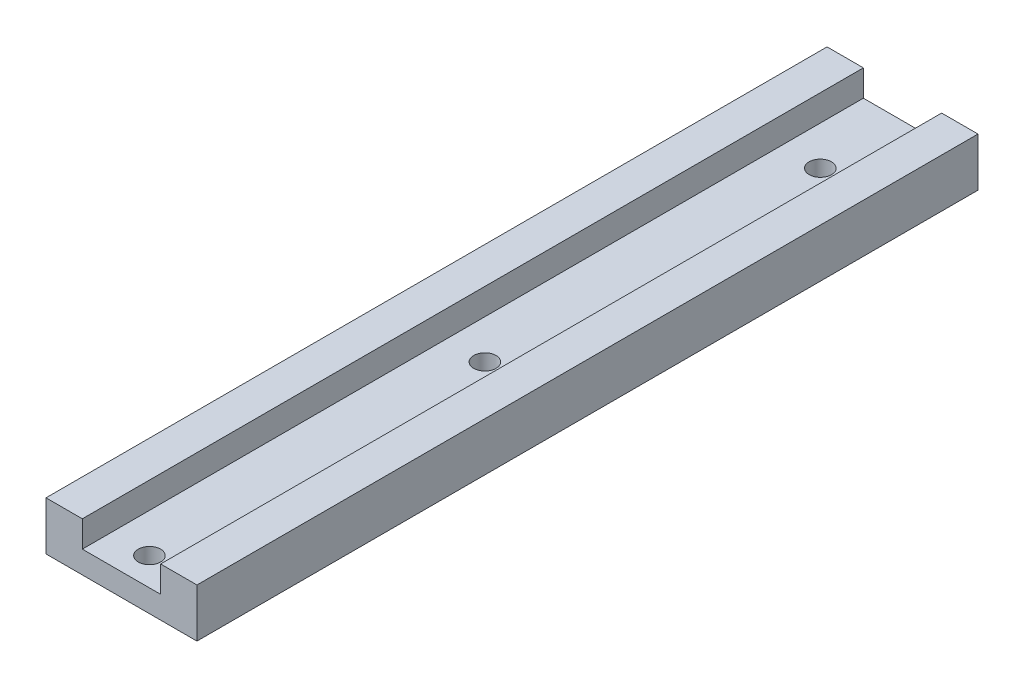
from build123d import *

# Parameters (mm, degrees)
BOSS_EXTRUDE1_DEPTH = 139.7
SKETCH2_R           = 2
CUT_EXTRUDE1_DEPTH  = 141.429448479
LPATTERN1_COUNT     = 3
LPATTERN1_PITCH     = 60


with BuildPart() as part:
    # Sketch1 → Boss-Extrude1 (new body)
    with BuildSketch(Plane.XY):
        Polygon((7, 4.35), (13.5, 4.35), (13.5, -4.35), (-13.5, -4.35), (-13.5, 4.35), (-7, 4.35), (-7, -0.35), (7, -0.35), align=None)
    extrude(amount=BOSS_EXTRUDE1_DEPTH)

    # Sketch2 → Cut-Extrude1 (cut, through all)
    with BuildSketch(Plane(origin=(0, -0.35, 0), x_dir=(1, 0, 0), z_dir=(0, 1, 0))):
        with Locations(Location((0, -134.7, 0), (0, 0, 180))):
            Circle(SKETCH2_R)
    cut_extrude1 = extrude(amount=-CUT_EXTRUDE1_DEPTH, mode=Mode.SUBTRACT)

    # LPattern1: Cut-Extrude1 ×3
    with Locations(*[(0, 0, -i * LPATTERN1_PITCH) for i in range(1, LPATTERN1_COUNT)]):
        add(cut_extrude1, mode=Mode.SUBTRACT)


solid = part.part
